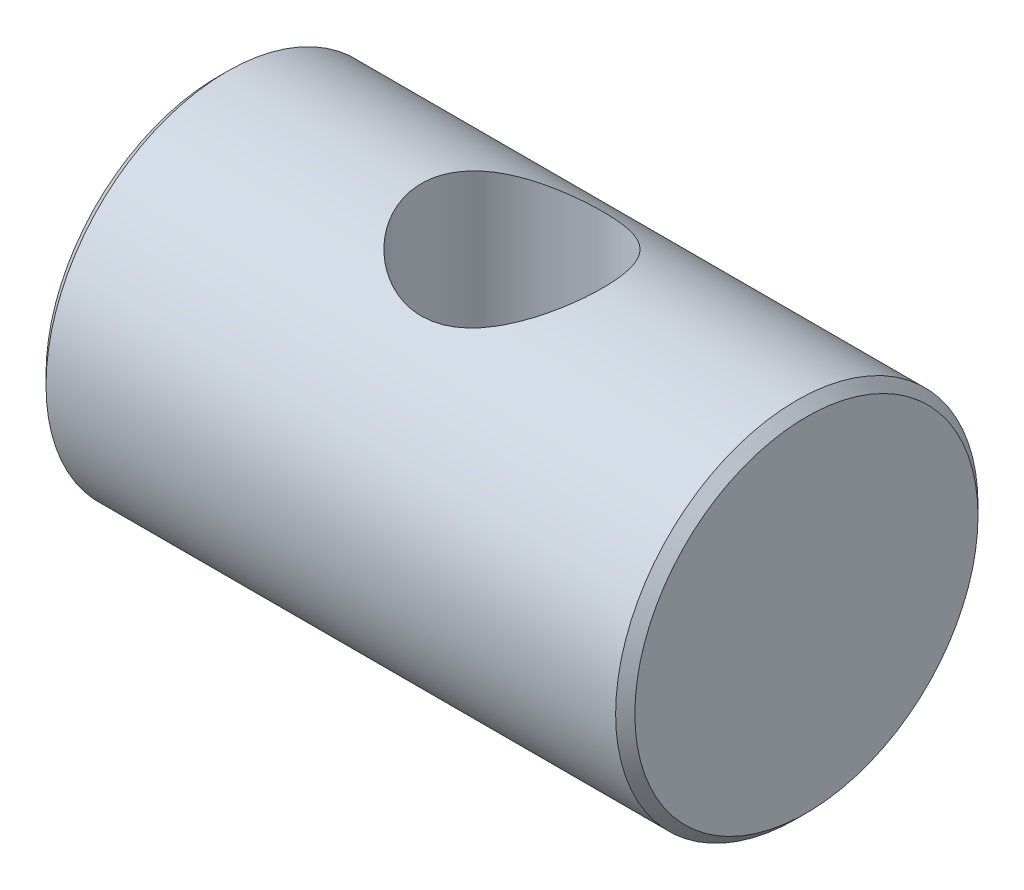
ISO-10303-21;
HEADER;
FILE_DESCRIPTION(('STEP AP214'),'2;1');
FILE_NAME('part.step','',(''),(''),'','','');
FILE_SCHEMA(('AUTOMOTIVE_DESIGN { 1 0 10303 214 1 1 1 1 }'));
ENDSEC;
DATA;
#1=APPLICATION_CONTEXT('core data for automotive mechanical design processes');
#2=APPLICATION_PROTOCOL_DEFINITION('international standard','automotive_design',2000,#1);
#3=PRODUCT_CONTEXT('',#1,'mechanical');
#4=PRODUCT('Part','Part','',(#3));
#5=PRODUCT_RELATED_PRODUCT_CATEGORY('part','',(#4));
#6=PRODUCT_DEFINITION_FORMATION('','',#4);
#7=PRODUCT_DEFINITION_CONTEXT('part definition',#1,'design');
#8=PRODUCT_DEFINITION('design','',#6,#7);
#9=PRODUCT_DEFINITION_SHAPE('','',#8);
#10=(LENGTH_UNIT() NAMED_UNIT(*) SI_UNIT(.MILLI.,.METRE.));
#11=(NAMED_UNIT(*) PLANE_ANGLE_UNIT() SI_UNIT($,.RADIAN.));
#12=(NAMED_UNIT(*) SI_UNIT($,.STERADIAN.) SOLID_ANGLE_UNIT());
#13=UNCERTAINTY_MEASURE_WITH_UNIT(LENGTH_MEASURE(1.E-05),#10,'distance_accuracy_value','');
#14=(GEOMETRIC_REPRESENTATION_CONTEXT(3) GLOBAL_UNCERTAINTY_ASSIGNED_CONTEXT((#13)) GLOBAL_UNIT_ASSIGNED_CONTEXT((#10,
#11,#12)) REPRESENTATION_CONTEXT('',''));
#15=CARTESIAN_POINT('',(0.,0.,0.));
#16=DIRECTION('',(0.,0.,1.));
#17=DIRECTION('',(1.,0.,0.));
#18=AXIS2_PLACEMENT_3D('',#15,#16,#17);
#19=CARTESIAN_POINT('',(6.5,0.,0.));
#20=DIRECTION('',(1.,0.,0.));
#21=DIRECTION('',(0.,0.,-1.));
#22=AXIS2_PLACEMENT_3D('',#19,#20,#21);
#23=CYLINDRICAL_SURFACE('',#22,4.);
#24=CARTESIAN_POINT('',(2.,-4.,0.));
#25=CARTESIAN_POINT('',(1.99999339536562,-3.99999426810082,0.105143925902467));
#26=CARTESIAN_POINT('',(1.99165985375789,-3.99580982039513,0.210413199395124));
#27=CARTESIAN_POINT('',(1.95869423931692,-3.97948312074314,0.417840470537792));
#28=CARTESIAN_POINT('',(1.93403121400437,-3.96732575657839,0.519992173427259));
#29=CARTESIAN_POINT('',(1.86961238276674,-3.93632558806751,0.717867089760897));
#30=CARTESIAN_POINT('',(1.82991523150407,-3.91750878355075,0.813613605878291));
#31=CARTESIAN_POINT('',(1.73685875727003,-3.87491553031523,0.996945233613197));
#32=CARTESIAN_POINT('',(1.68350051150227,-3.85113947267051,1.08453098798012));
#33=CARTESIAN_POINT('',(1.56096550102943,-3.79912516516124,1.25501563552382));
#34=CARTESIAN_POINT('',(1.49102704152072,-3.77070398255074,1.33731042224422));
#35=CARTESIAN_POINT('',(1.33895704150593,-3.71319940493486,1.48955888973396));
#36=CARTESIAN_POINT('',(1.25681629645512,-3.68411552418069,1.55950316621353));
#37=CARTESIAN_POINT('',(1.07503330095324,-3.62597902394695,1.69050400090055));
#38=CARTESIAN_POINT('',(0.974527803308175,-3.59710373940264,1.75045067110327));
#39=CARTESIAN_POINT('',(0.763265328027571,-3.54571957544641,1.85233645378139));
#40=CARTESIAN_POINT('',(0.652515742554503,-3.52320615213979,1.89428842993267));
#41=CARTESIAN_POINT('',(0.430669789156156,-3.48915734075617,1.95626488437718));
#42=CARTESIAN_POINT('',(0.319991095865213,-3.47704543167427,1.97745171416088));
#43=CARTESIAN_POINT('',(0.0960423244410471,-3.46363779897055,2.00085398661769));
#44=CARTESIAN_POINT('',(-0.0172250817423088,-3.46233138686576,2.00308817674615));
#45=CARTESIAN_POINT('',(-0.228572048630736,-3.47021860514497,1.98937457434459));
#46=CARTESIAN_POINT('',(-0.3268480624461,-3.47817527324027,1.97556911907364));
#47=CARTESIAN_POINT('',(-0.519443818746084,-3.50152457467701,1.93387969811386));
#48=CARTESIAN_POINT('',(-0.613762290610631,-3.51691957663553,1.9059912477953));
#49=CARTESIAN_POINT('',(-0.798458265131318,-3.55374952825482,1.83641956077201));
#50=CARTESIAN_POINT('',(-0.888692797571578,-3.57531681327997,1.79443013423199));
#51=CARTESIAN_POINT('',(-1.06126858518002,-3.62206808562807,1.698083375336));
#52=CARTESIAN_POINT('',(-1.14360627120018,-3.64725369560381,1.64372048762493));
#53=CARTESIAN_POINT('',(-1.30904250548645,-3.70226315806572,1.51613210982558));
#54=CARTESIAN_POINT('',(-1.39091374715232,-3.73227020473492,1.44138891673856));
#55=CARTESIAN_POINT('',(-1.5414708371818,-3.79095246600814,1.27911115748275));
#56=CARTESIAN_POINT('',(-1.61015038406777,-3.81962703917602,1.19157051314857));
#57=CARTESIAN_POINT('',(-1.73537132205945,-3.87403974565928,1.0010330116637));
#58=CARTESIAN_POINT('',(-1.79120094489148,-3.89957968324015,0.897507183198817));
#59=CARTESIAN_POINT('',(-1.88419405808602,-3.94315762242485,0.680932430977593));
#60=CARTESIAN_POINT('',(-1.92137237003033,-3.96120157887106,0.567891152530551));
#61=CARTESIAN_POINT('',(-1.97295080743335,-3.98648667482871,0.345532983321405));
#62=CARTESIAN_POINT('',(-1.98898247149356,-3.9944987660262,0.236683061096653));
#63=CARTESIAN_POINT('',(-2.00292946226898,-4.00146026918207,0.0175591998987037));
#64=CARTESIAN_POINT('',(-2.00085337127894,-4.00041397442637,-0.092714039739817));
#65=CARTESIAN_POINT('',(-1.97958662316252,-3.9898238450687,-0.302465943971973));
#66=CARTESIAN_POINT('',(-1.96173493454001,-3.98094491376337,-0.402118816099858));
#67=CARTESIAN_POINT('',(-1.91152385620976,-3.95644342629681,-0.596813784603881));
#68=CARTESIAN_POINT('',(-1.87916286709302,-3.94082012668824,-0.691855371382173));
#69=CARTESIAN_POINT('',(-1.80000306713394,-3.90368502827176,-0.877777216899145));
#70=CARTESIAN_POINT('',(-1.75281789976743,-3.88201763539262,-0.968460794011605));
#71=CARTESIAN_POINT('',(-1.64578492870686,-3.83487948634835,-1.14092272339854));
#72=CARTESIAN_POINT('',(-1.58593173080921,-3.80940711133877,-1.22269725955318));
#73=CARTESIAN_POINT('',(-1.44847914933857,-3.75416442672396,-1.38353537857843));
#74=CARTESIAN_POINT('',(-1.36971426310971,-3.72421769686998,-1.46154415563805));
#75=CARTESIAN_POINT('',(-1.20014969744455,-3.6652478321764,-1.60371264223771));
#76=CARTESIAN_POINT('',(-1.10934176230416,-3.63622534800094,-1.66786277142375));
#77=CARTESIAN_POINT('',(-0.91271269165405,-3.58102384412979,-1.78341582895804));
#78=CARTESIAN_POINT('',(-0.806377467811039,-3.55505059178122,-1.8340509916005));
#79=CARTESIAN_POINT('',(-0.58497986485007,-3.51148144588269,-1.91616565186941));
#80=CARTESIAN_POINT('',(-0.469928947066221,-3.493874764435,-1.94766983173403));
#81=CARTESIAN_POINT('',(-0.246179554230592,-3.47123002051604,-1.98772337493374));
#82=CARTESIAN_POINT('',(-0.137931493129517,-3.4651476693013,-1.9981859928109));
#83=CARTESIAN_POINT('',(0.0788941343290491,-3.46330709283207,-2.0013783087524));
#84=CARTESIAN_POINT('',(0.187471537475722,-3.4675443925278,-1.99411569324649));
#85=CARTESIAN_POINT('',(0.390967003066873,-3.48475724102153,-1.96385225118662));
#86=CARTESIAN_POINT('',(0.486200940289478,-3.49686188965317,-1.94241662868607));
#87=CARTESIAN_POINT('',(0.671616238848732,-3.52742032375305,-1.88635071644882));
#88=CARTESIAN_POINT('',(0.761795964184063,-3.54587615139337,-1.85171618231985));
#89=CARTESIAN_POINT('',(0.941249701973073,-3.58857060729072,-1.76763149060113));
#90=CARTESIAN_POINT('',(1.03005580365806,-3.61311444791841,-1.7173422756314));
#91=CARTESIAN_POINT('',(1.19854907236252,-3.66470663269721,-1.60430194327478));
#92=CARTESIAN_POINT('',(1.27823146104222,-3.69175627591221,-1.54154434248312));
#93=CARTESIAN_POINT('',(1.43628396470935,-3.74924646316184,-1.39640665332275));
#94=CARTESIAN_POINT('',(1.51331820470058,-3.77969966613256,-1.31256884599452));
#95=CARTESIAN_POINT('',(1.65252596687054,-3.83755504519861,-1.1323096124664));
#96=CARTESIAN_POINT('',(1.71469147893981,-3.8649555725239,-1.0358814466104));
#97=CARTESIAN_POINT('',(1.82247272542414,-3.91396019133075,-0.831863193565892));
#98=CARTESIAN_POINT('',(1.86796833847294,-3.93552192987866,-0.724199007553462));
#99=CARTESIAN_POINT('',(1.93961633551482,-3.97002682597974,-0.501484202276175));
#100=CARTESIAN_POINT('',(1.96582369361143,-3.98299446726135,-0.386455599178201));
#101=CARTESIAN_POINT('',(1.98779482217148,-3.99390923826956,-0.225203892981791));
#102=CARTESIAN_POINT('',(1.99236528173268,-3.99618730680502,-0.18032375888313));
#103=CARTESIAN_POINT('',(1.99846933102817,-3.99923393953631,-0.0903034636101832));
#104=CARTESIAN_POINT('',(2.00000283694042,-4.00000246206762,-0.0451632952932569));
#105=CARTESIAN_POINT('',(2.,-4.,0.));
#106=B_SPLINE_CURVE_WITH_KNOTS('',3,(#24,#25,#26,#27,#28,#29,#30,#31,#32,#33,#34,#35,#36,#37,
#38,#39,#40,#41,#42,#43,#44,#45,#46,#47,#48,#49,#50,#51,#52,#53,#54,#55,#56,#57,#58,#59,#60,#61,
#62,#63,#64,#65,#66,#67,#68,#69,#70,#71,#72,#73,#74,#75,#76,#77,#78,#79,#80,#81,#82,#83,#84,#85,
#86,#87,#88,#89,#90,#91,#92,#93,#94,#95,#96,#97,#98,#99,#100,#101,#102,#103,#104,#105),
.UNSPECIFIED.,.T.,.F.,(4,2,2,2,2,2,2,2,2,2,2,2,2,2,2,2,2,2,2,2,2,2,2,2,2,2,2,2,2,2,2,2,2,2,2,2,
2,2,2,2,4),(0.,0.315248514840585,0.631096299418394,0.945724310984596,1.26032752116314,
1.59396351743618,1.92785247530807,2.28763452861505,2.64715895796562,2.98516024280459,
3.32282714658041,3.62011424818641,3.91749607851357,4.22180480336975,4.52625042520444,
4.86929882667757,5.21251069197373,5.57166044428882,5.93052433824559,6.25966580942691,
6.58865129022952,6.89213813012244,7.19565843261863,7.50785712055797,7.82018901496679,
8.16319221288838,8.50643177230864,8.86629364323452,9.22569023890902,9.55058615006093,
9.87534119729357,10.1691586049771,10.463070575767,10.7767291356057,11.0905512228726,
11.4425048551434,11.7946476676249,12.1492802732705,12.502898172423,12.6383056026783,
12.7737167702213),.UNSPECIFIED.);
#107=CARTESIAN_POINT('',(2.,-4.,0.));
#108=VERTEX_POINT('',#107);
#109=EDGE_CURVE('E43',#108,#108,#106,.T.);
#110=ORIENTED_EDGE('',*,*,#109,.F.);
#111=EDGE_LOOP('',(#110));
#112=FACE_BOUND('',#111,.T.);
#113=CARTESIAN_POINT('',(0.,3.46410161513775,2.));
#114=CARTESIAN_POINT('',(0.104213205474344,3.46411185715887,1.99999158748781));
#115=CARTESIAN_POINT('',(0.208562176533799,3.46887633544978,1.99179963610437));
#116=CARTESIAN_POINT('',(0.414055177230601,3.48724701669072,1.95944672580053));
#117=CARTESIAN_POINT('',(0.515192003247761,3.50087179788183,1.93525221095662));
#118=CARTESIAN_POINT('',(0.710903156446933,3.53498701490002,1.8721998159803));
#119=CARTESIAN_POINT('',(0.80550925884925,3.55544089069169,1.83341988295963));
#120=CARTESIAN_POINT('',(0.986848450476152,3.60085327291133,1.74253507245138));
#121=CARTESIAN_POINT('',(1.07358111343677,3.62581202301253,1.69042947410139));
#122=CARTESIAN_POINT('',(1.24461144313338,3.67993738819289,1.569333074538));
#123=CARTESIAN_POINT('',(1.32811826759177,3.70928127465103,1.49930407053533));
#124=CARTESIAN_POINT('',(1.4828167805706,3.76743965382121,1.34650761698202));
#125=CARTESIAN_POINT('',(1.55400232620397,3.79625387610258,1.26373385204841));
#126=CARTESIAN_POINT('',(1.6867343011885,3.85242953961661,1.08097912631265));
#127=CARTESIAN_POINT('',(1.74730753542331,3.87956212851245,0.980214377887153));
#128=CARTESIAN_POINT('',(1.85028170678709,3.92701512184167,0.768314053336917));
#129=CARTESIAN_POINT('',(1.89269411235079,3.94733982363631,0.657185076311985));
#130=CARTESIAN_POINT('',(1.95500932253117,3.97760922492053,0.436089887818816));
#131=CARTESIAN_POINT('',(1.9762990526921,3.9881896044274,0.326603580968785));
#132=CARTESIAN_POINT('',(2.00033223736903,4.00015167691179,0.10514125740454));
#133=CARTESIAN_POINT('',(2.00308691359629,4.00153893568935,-0.00683321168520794));
#134=CARTESIAN_POINT('',(1.99050665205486,3.99525963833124,-0.219665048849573));
#135=CARTESIAN_POINT('',(1.97672396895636,3.98836991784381,-0.320642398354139));
#136=CARTESIAN_POINT('',(1.93423831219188,3.96748490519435,-0.518627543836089));
#137=CARTESIAN_POINT('',(1.90553422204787,3.95348908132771,-0.615635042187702));
#138=CARTESIAN_POINT('',(1.83383486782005,3.91943166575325,-0.80461878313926));
#139=CARTESIAN_POINT('',(1.79064737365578,3.89928883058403,-0.896506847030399));
#140=CARTESIAN_POINT('',(1.6914731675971,3.8547529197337,-1.07195360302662));
#141=CARTESIAN_POINT('',(1.63548187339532,3.83035832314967,-1.15550929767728));
#142=CARTESIAN_POINT('',(1.50620929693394,3.7768878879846,-1.3203473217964));
#143=CARTESIAN_POINT('',(1.43179394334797,3.7475875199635,-1.40066815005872));
#144=CARTESIAN_POINT('',(1.27082055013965,3.68908681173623,-1.54820874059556));
#145=CARTESIAN_POINT('',(1.18425325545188,3.65988656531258,-1.61541842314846));
#146=CARTESIAN_POINT('',(0.994703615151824,3.60288312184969,-1.73901066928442));
#147=CARTESIAN_POINT('',(0.891027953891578,3.57528639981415,-1.7944346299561));
#148=CARTESIAN_POINT('',(0.674124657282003,3.52750900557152,-1.88663822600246));
#149=CARTESIAN_POINT('',(0.560907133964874,3.50732060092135,-1.92343731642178));
#150=CARTESIAN_POINT('',(0.337570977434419,3.47889271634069,-1.97436042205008));
#151=CARTESIAN_POINT('',(0.227917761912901,3.46983311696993,-1.99005024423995));
#152=CARTESIAN_POINT('',(0.0071973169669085,3.46235838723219,-2.00303389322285));
#153=CARTESIAN_POINT('',(-0.103868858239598,3.46393573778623,-2.00034071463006));
#154=CARTESIAN_POINT('',(-0.311307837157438,3.47668673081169,-1.97807208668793));
#155=CARTESIAN_POINT('',(-0.407958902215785,3.48679175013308,-1.96037563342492));
#156=CARTESIAN_POINT('',(-0.596735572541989,3.51388043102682,-1.91139256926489));
#157=CARTESIAN_POINT('',(-0.688859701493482,3.53086632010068,-1.88010155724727));
#158=CARTESIAN_POINT('',(-0.870822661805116,3.57072444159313,-1.80329517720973));
#159=CARTESIAN_POINT('',(-0.960358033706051,3.59383286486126,-1.7571881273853));
#160=CARTESIAN_POINT('',(-1.13093854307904,3.643122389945,-1.65257412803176));
#161=CARTESIAN_POINT('',(-1.21197928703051,3.66930506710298,-1.59406080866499));
#162=CARTESIAN_POINT('',(-1.37395753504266,3.72575996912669,-1.45767433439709));
#163=CARTESIAN_POINT('',(-1.45359430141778,3.75613166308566,-1.37829054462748));
#164=CARTESIAN_POINT('',(-1.59882447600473,3.81468469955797,-1.20680899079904));
#165=CARTESIAN_POINT('',(-1.66441314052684,3.84286530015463,-1.11470694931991));
#166=CARTESIAN_POINT('',(-1.78114745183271,3.89482723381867,-0.917070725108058));
#167=CARTESIAN_POINT('',(-1.83186623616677,3.91847283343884,-0.811246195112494));
#168=CARTESIAN_POINT('',(-1.91427580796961,3.95766709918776,-0.591044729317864));
#169=CARTESIAN_POINT('',(-1.9459833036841,3.97322287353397,-0.476675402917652));
#170=CARTESIAN_POINT('',(-1.98673712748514,3.99335016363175,-0.253959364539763));
#171=CARTESIAN_POINT('',(-1.99759574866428,3.9987985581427,-0.146022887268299));
#172=CARTESIAN_POINT('',(-2.00168653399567,4.00084260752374,0.0702519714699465));
#173=CARTESIAN_POINT('',(-1.99492486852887,3.99744136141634,0.178590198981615));
#174=CARTESIAN_POINT('',(-1.96516717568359,3.98267937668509,0.38507598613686));
#175=CARTESIAN_POINT('',(-1.94327026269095,3.97185789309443,0.483424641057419));
#176=CARTESIAN_POINT('',(-1.88534604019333,3.94384187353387,0.674891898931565));
#177=CARTESIAN_POINT('',(-1.84931670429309,3.92664642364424,0.768009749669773));
#178=CARTESIAN_POINT('',(-1.7625457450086,3.88651861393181,0.950846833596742));
#179=CARTESIAN_POINT('',(-1.71124078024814,3.86337234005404,1.0402503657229));
#180=CARTESIAN_POINT('',(-1.59608471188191,3.81376266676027,1.20954920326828));
#181=CARTESIAN_POINT('',(-1.53222784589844,3.78729774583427,1.28944011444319));
#182=CARTESIAN_POINT('',(-1.38640336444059,3.73057218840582,1.44582833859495));
#183=CARTESIAN_POINT('',(-1.30326581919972,3.70019591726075,1.52119665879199));
#184=CARTESIAN_POINT('',(-1.12510777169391,3.64126158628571,1.65732528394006));
#185=CARTESIAN_POINT('',(-1.03007686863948,3.61270515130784,1.71807266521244));
#186=CARTESIAN_POINT('',(-0.826691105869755,3.55999186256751,1.82486714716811));
#187=CARTESIAN_POINT('',(-0.718010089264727,3.53600256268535,1.87038902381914));
#188=CARTESIAN_POINT('',(-0.549421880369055,3.5069621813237,1.92395929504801));
#189=CARTESIAN_POINT('',(-0.492352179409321,3.49844389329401,1.93935666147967));
#190=CARTESIAN_POINT('',(-0.37676744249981,3.48406059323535,1.96508069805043));
#191=CARTESIAN_POINT('',(-0.318253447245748,3.4781937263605,1.97541091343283));
#192=CARTESIAN_POINT('',(-0.21639921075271,3.47059023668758,1.9887293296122));
#193=CARTESIAN_POINT('',(-0.173266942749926,3.46816389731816,1.99295091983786));
#194=CARTESIAN_POINT('',(-0.0867643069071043,3.46491740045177,1.99858810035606));
#195=CARTESIAN_POINT('',(-0.0433939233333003,3.46409735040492,2.00000350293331));
#196=CARTESIAN_POINT('',(0.,3.46410161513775,2.));
#197=B_SPLINE_CURVE_WITH_KNOTS('',3,(#113,#114,#115,#116,#117,#118,#119,#120,#121,#122,#123,
#124,#125,#126,#127,#128,#129,#130,#131,#132,#133,#134,#135,#136,#137,#138,#139,#140,#141,#142,
#143,#144,#145,#146,#147,#148,#149,#150,#151,#152,#153,#154,#155,#156,#157,#158,#159,#160,#161,
#162,#163,#164,#165,#166,#167,#168,#169,#170,#171,#172,#173,#174,#175,#176,#177,#178,#179,#180,
#181,#182,#183,#184,#185,#186,#187,#188,#189,#190,#191,#192,#193,#194,#195,#196),.UNSPECIFIED.,
.T.,.F.,(4,2,2,2,2,2,2,2,2,2,2,2,2,2,2,2,2,2,2,2,2,2,2,2,2,2,2,2,2,2,2,2,2,2,2,2,2,2,2,2,2,4),
(0.,0.312464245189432,0.62558578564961,0.937057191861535,1.24854545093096,1.58572462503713,
1.92307142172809,2.28315784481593,2.64301653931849,2.97726969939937,3.31132047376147,
3.61632194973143,3.92134625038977,4.2305906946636,4.5399459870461,4.87854382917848,
5.21740096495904,5.57777683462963,5.93777548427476,6.2692458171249,6.60048186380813,
6.89548366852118,7.19058104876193,7.49934592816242,7.80826972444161,8.15613487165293,
8.50411729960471,8.86128362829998,9.2181355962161,9.5422454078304,9.8662417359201,
10.1688884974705,10.4715786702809,10.7872150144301,11.1029966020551,11.450204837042,
11.7977188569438,12.1562149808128,12.3351395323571,12.5139387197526,12.6440387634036,
12.7741475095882),.UNSPECIFIED.);
#198=CARTESIAN_POINT('',(0.,3.46410161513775,2.));
#199=VERTEX_POINT('',#198);
#200=EDGE_CURVE('E52',#199,#199,#197,.T.);
#201=ORIENTED_EDGE('',*,*,#200,.F.);
#202=EDGE_LOOP('',(#201));
#203=FACE_BOUND('',#202,.T.);
#204=CARTESIAN_POINT('',(-6.28786796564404,0.,0.));
#205=DIRECTION('',(1.,0.,0.));
#206=DIRECTION('',(0.,0.,-1.));
#207=AXIS2_PLACEMENT_3D('',#204,#205,#206);
#208=CIRCLE('',#207,4.);
#209=CARTESIAN_POINT('',(-6.28786796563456,0.,-4.00000000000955));
#210=VERTEX_POINT('',#209);
#211=EDGE_CURVE('E38',#210,#210,#208,.T.);
#212=ORIENTED_EDGE('',*,*,#211,.T.);
#213=EDGE_LOOP('',(#212));
#214=FACE_BOUND('',#213,.T.);
#215=CARTESIAN_POINT('',(6.28786796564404,0.,0.));
#216=DIRECTION('',(1.,0.,0.));
#217=DIRECTION('',(0.,0.,-1.));
#218=AXIS2_PLACEMENT_3D('',#215,#216,#217);
#219=CIRCLE('',#218,4.);
#220=CARTESIAN_POINT('',(6.28786796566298,0.,-4.00000000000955));
#221=VERTEX_POINT('',#220);
#222=EDGE_CURVE('E42',#221,#221,#219,.F.);
#223=ORIENTED_EDGE('',*,*,#222,.T.);
#224=EDGE_LOOP('',(#223));
#225=FACE_BOUND('',#224,.T.);
#226=ADVANCED_FACE('F14',(#112,#203,#214,#225),#23,.T.);
#227=CARTESIAN_POINT('',(-6.28786796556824,0.,0.));
#228=DIRECTION('',(1.,0.,0.));
#229=DIRECTION('',(0.,0.,-1.));
#230=AXIS2_PLACEMENT_3D('',#227,#228,#229);
#231=CONICAL_SURFACE('',#230,4.00000000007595,0.785398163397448);
#232=CARTESIAN_POINT('',(-6.50000000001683,0.,0.));
#233=DIRECTION('',(1.,0.,0.));
#234=DIRECTION('',(0.,0.,-1.));
#235=AXIS2_PLACEMENT_3D('',#232,#233,#234);
#236=CIRCLE('',#235,3.78786796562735);
#237=CARTESIAN_POINT('',(-6.50000000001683,0.,-3.78786796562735));
#238=VERTEX_POINT('',#237);
#239=EDGE_CURVE('E23',#238,#238,#236,.T.);
#240=ORIENTED_EDGE('',*,*,#239,.T.);
#241=EDGE_LOOP('',(#240));
#242=FACE_BOUND('',#241,.T.);
#243=ORIENTED_EDGE('',*,*,#211,.F.);
#244=EDGE_LOOP('',(#243));
#245=FACE_BOUND('',#244,.T.);
#246=ADVANCED_FACE('F39',(#242,#245),#231,.T.);
#247=CARTESIAN_POINT('',(6.28786796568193,0.,0.));
#248=DIRECTION('',(-1.,0.,0.));
#249=DIRECTION('',(0.,0.,1.));
#250=AXIS2_PLACEMENT_3D('',#247,#248,#249);
#251=CONICAL_SURFACE('',#250,4.0000000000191,0.785398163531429);
#252=ORIENTED_EDGE('',*,*,#222,.F.);
#253=EDGE_LOOP('',(#252));
#254=FACE_BOUND('',#253,.T.);
#255=CARTESIAN_POINT('',(6.49999999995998,0.,0.));
#256=DIRECTION('',(-1.,0.,0.));
#257=DIRECTION('',(0.,0.,1.));
#258=AXIS2_PLACEMENT_3D('',#255,#256,#257);
#259=CIRCLE('',#258,3.7878679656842);
#260=CARTESIAN_POINT('',(6.49999999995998,0.,-3.7878679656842));
#261=VERTEX_POINT('',#260);
#262=EDGE_CURVE('E9',#261,#261,#259,.T.);
#263=ORIENTED_EDGE('',*,*,#262,.T.);
#264=EDGE_LOOP('',(#263));
#265=FACE_BOUND('',#264,.T.);
#266=ADVANCED_FACE('F68',(#254,#265),#251,.T.);
#267=CARTESIAN_POINT('',(6.5,3.78786796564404,0.));
#268=DIRECTION('',(-1.,0.,0.));
#269=DIRECTION('',(0.,0.,1.));
#270=AXIS2_PLACEMENT_3D('',#267,#268,#269);
#271=PLANE('',#270);
#272=ORIENTED_EDGE('',*,*,#262,.F.);
#273=EDGE_LOOP('',(#272));
#274=FACE_BOUND('',#273,.T.);
#275=ADVANCED_FACE('F75',(#274),#271,.F.);
#276=CARTESIAN_POINT('',(-6.5,0.,0.));
#277=DIRECTION('',(1.,0.,0.));
#278=DIRECTION('',(0.,0.,-1.));
#279=AXIS2_PLACEMENT_3D('',#276,#277,#278);
#280=PLANE('',#279);
#281=ORIENTED_EDGE('',*,*,#239,.F.);
#282=EDGE_LOOP('',(#281));
#283=FACE_BOUND('',#282,.T.);
#284=ADVANCED_FACE('F16',(#283),#280,.F.);
#285=CARTESIAN_POINT('',(0.,-4.,0.));
#286=DIRECTION('',(0.,1.,0.));
#287=DIRECTION('',(0.,0.,1.));
#288=AXIS2_PLACEMENT_3D('',#285,#286,#287);
#289=CYLINDRICAL_SURFACE('',#288,2.);
#290=ORIENTED_EDGE('',*,*,#109,.T.);
#291=EDGE_LOOP('',(#290));
#292=FACE_BOUND('',#291,.T.);
#293=ORIENTED_EDGE('',*,*,#200,.T.);
#294=EDGE_LOOP('',(#293));
#295=FACE_BOUND('',#294,.T.);
#296=ADVANCED_FACE('F79',(#292,#295),#289,.F.);
#297=CLOSED_SHELL('',(#226,#246,#266,#275,#284,#296));
#298=MANIFOLD_SOLID_BREP('B1',#297);
#299=ADVANCED_BREP_SHAPE_REPRESENTATION('',(#18,#298),#14);
#300=SHAPE_DEFINITION_REPRESENTATION(#9,#299);
ENDSEC;
END-ISO-10303-21;
